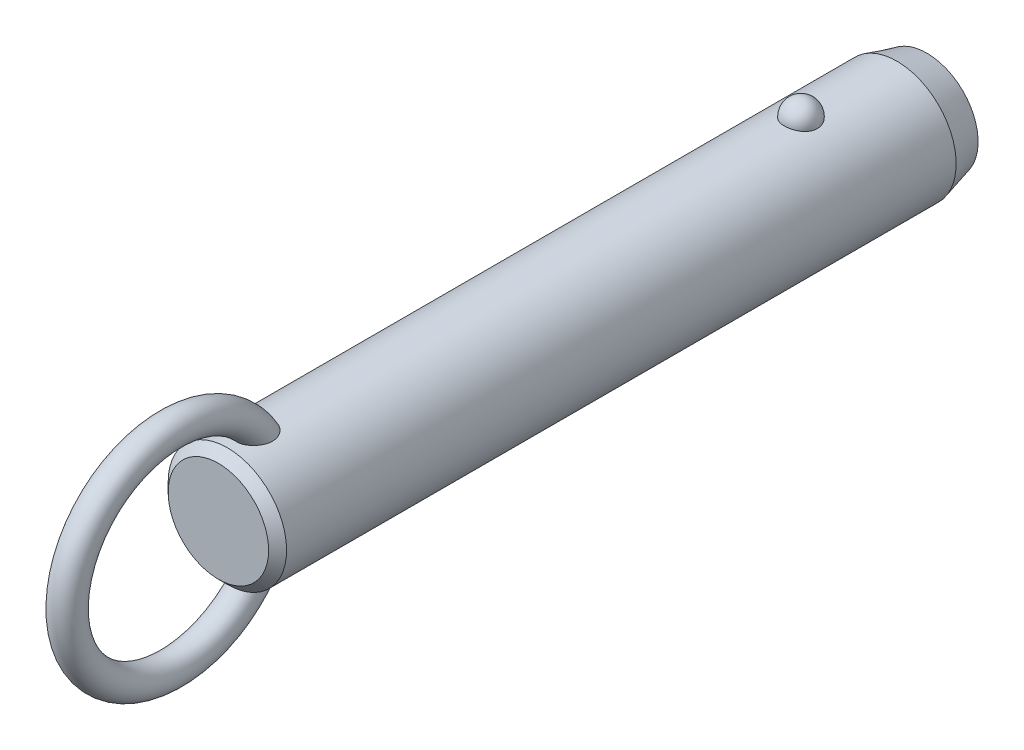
ISO-10303-21;
HEADER;
FILE_DESCRIPTION(('STEP AP214'),'2;1');
FILE_NAME('part.step','',(''),(''),'','','');
FILE_SCHEMA(('AUTOMOTIVE_DESIGN { 1 0 10303 214 1 1 1 1 }'));
ENDSEC;
DATA;
#1=APPLICATION_CONTEXT('core data for automotive mechanical design processes');
#2=APPLICATION_PROTOCOL_DEFINITION('international standard','automotive_design',2000,#1);
#3=PRODUCT_CONTEXT('',#1,'mechanical');
#4=PRODUCT('Part','Part','',(#3));
#5=PRODUCT_RELATED_PRODUCT_CATEGORY('part','',(#4));
#6=PRODUCT_DEFINITION_FORMATION('','',#4);
#7=PRODUCT_DEFINITION_CONTEXT('part definition',#1,'design');
#8=PRODUCT_DEFINITION('design','',#6,#7);
#9=PRODUCT_DEFINITION_SHAPE('','',#8);
#10=(LENGTH_UNIT() NAMED_UNIT(*) SI_UNIT(.MILLI.,.METRE.));
#11=(NAMED_UNIT(*) PLANE_ANGLE_UNIT() SI_UNIT($,.RADIAN.));
#12=(NAMED_UNIT(*) SI_UNIT($,.STERADIAN.) SOLID_ANGLE_UNIT());
#13=UNCERTAINTY_MEASURE_WITH_UNIT(LENGTH_MEASURE(1.E-05),#10,'distance_accuracy_value','');
#14=(GEOMETRIC_REPRESENTATION_CONTEXT(3) GLOBAL_UNCERTAINTY_ASSIGNED_CONTEXT((#13)) GLOBAL_UNIT_ASSIGNED_CONTEXT((#10,
#11,#12)) REPRESENTATION_CONTEXT('',''));
#15=CARTESIAN_POINT('',(0.,0.,0.));
#16=DIRECTION('',(0.,0.,1.));
#17=DIRECTION('',(1.,0.,0.));
#18=AXIS2_PLACEMENT_3D('',#15,#16,#17);
#19=CARTESIAN_POINT('',(0.,0.,66.));
#20=DIRECTION('',(0.,0.,-1.));
#21=DIRECTION('',(-1.,0.,0.));
#22=AXIS2_PLACEMENT_3D('',#19,#20,#21);
#23=CYLINDRICAL_SURFACE('',#22,7.9);
#24=CARTESIAN_POINT('',(2.1785689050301,7.59367088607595,-2.19999999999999));
#25=CARTESIAN_POINT('',(2.17856679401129,7.59367269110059,-2.07701843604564));
#26=CARTESIAN_POINT('',(2.16853481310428,7.59657145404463,-1.95401006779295));
#27=CARTESIAN_POINT('',(2.12864689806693,7.607843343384,-1.71147811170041));
#28=CARTESIAN_POINT('',(2.09878338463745,7.61621856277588,-1.59195587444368));
#29=CARTESIAN_POINT('',(2.0199931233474,7.63749180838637,-1.3598563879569));
#30=CARTESIAN_POINT('',(1.97107475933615,7.6503878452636,-1.24727610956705));
#31=CARTESIAN_POINT('',(1.85539377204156,7.67926115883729,-1.03213234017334));
#32=CARTESIAN_POINT('',(1.78863158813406,7.69523835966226,-0.929568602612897));
#33=CARTESIAN_POINT('',(1.63856494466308,7.7285848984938,-0.736786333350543));
#34=CARTESIAN_POINT('',(1.55518140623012,7.7459606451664,-0.646630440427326));
#35=CARTESIAN_POINT('',(1.37422937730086,7.78009978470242,-0.481747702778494));
#36=CARTESIAN_POINT('',(1.27666086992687,7.79686317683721,-0.407020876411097));
#37=CARTESIAN_POINT('',(1.07024728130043,7.82786153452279,-0.275278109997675));
#38=CARTESIAN_POINT('',(0.961434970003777,7.84210353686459,-0.218212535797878));
#39=CARTESIAN_POINT('',(0.735351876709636,7.86652194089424,-0.123146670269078));
#40=CARTESIAN_POINT('',(0.618082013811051,7.87669878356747,-0.085144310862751));
#41=CARTESIAN_POINT('',(0.380637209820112,7.89170521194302,-0.0298158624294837));
#42=CARTESIAN_POINT('',(0.260550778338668,7.89662650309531,-0.0121347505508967));
#43=CARTESIAN_POINT('',(0.0190117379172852,7.90090003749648,0.00324379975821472));
#44=CARTESIAN_POINT('',(-0.102440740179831,7.90025280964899,0.00094313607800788));
#45=CARTESIAN_POINT('',(-0.341452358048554,7.89351056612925,-0.0233955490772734));
#46=CARTESIAN_POINT('',(-0.459042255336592,7.88749257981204,-0.0451545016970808));
#47=CARTESIAN_POINT('',(-0.688796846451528,7.87075812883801,-0.107408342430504));
#48=CARTESIAN_POINT('',(-0.800961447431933,7.86004158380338,-0.147903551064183));
#49=CARTESIAN_POINT('',(-1.01743634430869,7.83497131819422,-0.246799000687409));
#50=CARTESIAN_POINT('',(-1.12169791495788,7.82059709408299,-0.305300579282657));
#51=CARTESIAN_POINT('',(-1.31891765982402,7.78976470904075,-0.438549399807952));
#52=CARTESIAN_POINT('',(-1.41187469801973,7.77330633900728,-0.513298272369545));
#53=CARTESIAN_POINT('',(-1.58577142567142,7.73972434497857,-0.678622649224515));
#54=CARTESIAN_POINT('',(-1.66645140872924,7.72259402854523,-0.769470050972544));
#55=CARTESIAN_POINT('',(-1.81161503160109,7.68983776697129,-0.963538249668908));
#56=CARTESIAN_POINT('',(-1.87609753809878,7.6742119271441,-1.06675991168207));
#57=CARTESIAN_POINT('',(-1.98790138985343,7.6460202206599,-1.28401170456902));
#58=CARTESIAN_POINT('',(-2.03501994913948,7.63349104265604,-1.39815107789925));
#59=CARTESIAN_POINT('',(-2.10986724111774,7.6131449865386,-1.63301784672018));
#60=CARTESIAN_POINT('',(-2.1375965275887,7.60532797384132,-1.75374505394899));
#61=CARTESIAN_POINT('',(-2.17289256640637,7.5953195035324,-1.99782562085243));
#62=CARTESIAN_POINT('',(-2.18054294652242,7.59310471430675,-2.12116592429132));
#63=CARTESIAN_POINT('',(-2.17572919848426,7.59448538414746,-2.36741799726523));
#64=CARTESIAN_POINT('',(-2.1632656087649,7.59808068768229,-2.49032977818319));
#65=CARTESIAN_POINT('',(-2.11865035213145,7.61064035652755,-2.73161015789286));
#66=CARTESIAN_POINT('',(-2.08659579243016,7.61957823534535,-2.84999812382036));
#67=CARTESIAN_POINT('',(-2.00367799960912,7.64179982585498,-3.07955956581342));
#68=CARTESIAN_POINT('',(-1.9528140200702,7.65508371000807,-3.19073275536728));
#69=CARTESIAN_POINT('',(-1.83321113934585,7.68460381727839,-3.40337899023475));
#70=CARTESIAN_POINT('',(-1.76437735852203,7.70085556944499,-3.50479651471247));
#71=CARTESIAN_POINT('',(-1.61069526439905,7.73445734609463,-3.69446912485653));
#72=CARTESIAN_POINT('',(-1.52584634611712,7.75180741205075,-3.78272371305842));
#73=CARTESIAN_POINT('',(-1.34198059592,7.78574608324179,-3.94393987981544));
#74=CARTESIAN_POINT('',(-1.24291308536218,7.80233167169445,-4.01684434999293));
#75=CARTESIAN_POINT('',(-1.03352039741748,7.83281625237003,-4.14489386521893));
#76=CARTESIAN_POINT('',(-0.92319600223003,7.84671543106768,-4.20004014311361));
#77=CARTESIAN_POINT('',(-0.695822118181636,7.87011575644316,-4.29042017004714));
#78=CARTESIAN_POINT('',(-0.578872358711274,7.87966903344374,-4.32589112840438));
#79=CARTESIAN_POINT('',(-0.340410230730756,7.8935652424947,-4.37692226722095));
#80=CARTESIAN_POINT('',(-0.218898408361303,7.89790879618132,-4.39248482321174));
#81=CARTESIAN_POINT('',(0.0228107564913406,7.90087453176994,-4.40314405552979));
#82=CARTESIAN_POINT('',(0.142990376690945,7.89960185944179,-4.39861683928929));
#83=CARTESIAN_POINT('',(0.380829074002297,7.89171262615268,-4.37008293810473));
#84=CARTESIAN_POINT('',(0.498488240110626,7.8850962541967,-4.34607694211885));
#85=CARTESIAN_POINT('',(0.727535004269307,7.86726442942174,-4.27939317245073));
#86=CARTESIAN_POINT('',(0.838944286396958,7.85606616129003,-4.236785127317));
#87=CARTESIAN_POINT('',(1.05295421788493,7.83025654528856,-4.13408348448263));
#88=CARTESIAN_POINT('',(1.15555431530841,7.81564498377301,-4.07398879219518));
#89=CARTESIAN_POINT('',(1.35076763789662,7.7843022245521,-3.93687432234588));
#90=CARTESIAN_POINT('',(1.4432046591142,7.76754209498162,-3.85961036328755));
#91=CARTESIAN_POINT('',(1.6139111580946,7.73387857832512,-3.69076949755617));
#92=CARTESIAN_POINT('',(1.6921781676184,7.71697516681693,-3.59919010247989));
#93=CARTESIAN_POINT('',(1.83380875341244,7.6845643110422,-3.40247278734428));
#94=CARTESIAN_POINT('',(1.89689280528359,7.66908588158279,-3.29712873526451));
#95=CARTESIAN_POINT('',(2.0047823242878,7.64159441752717,-3.07707931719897));
#96=CARTESIAN_POINT('',(2.0495945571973,7.62958010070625,-2.96237743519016));
#97=CARTESIAN_POINT('',(2.11580183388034,7.61146617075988,-2.74040519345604));
#98=CARTESIAN_POINT('',(2.13929812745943,7.60484503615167,-2.63379846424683));
#99=CARTESIAN_POINT('',(2.17068242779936,7.59594664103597,-2.41813481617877));
#100=CARTESIAN_POINT('',(2.17857077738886,7.59366928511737,-2.30907795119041));
#101=CARTESIAN_POINT('',(2.1785689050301,7.59367088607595,-2.19999999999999));
#102=B_SPLINE_CURVE_WITH_KNOTS('',3,(#24,#25,#26,#27,#28,#29,#30,#31,#32,#33,#34,#35,#36,#37,
#38,#39,#40,#41,#42,#43,#44,#45,#46,#47,#48,#49,#50,#51,#52,#53,#54,#55,#56,#57,#58,#59,#60,#61,
#62,#63,#64,#65,#66,#67,#68,#69,#70,#71,#72,#73,#74,#75,#76,#77,#78,#79,#80,#81,#82,#83,#84,#85,
#86,#87,#88,#89,#90,#91,#92,#93,#94,#95,#96,#97,#98,#99,#100,#101),.UNSPECIFIED.,.T.,.F.,(4,2,2,
2,2,2,2,2,2,2,2,2,2,2,2,2,2,2,2,2,2,2,2,2,2,2,2,2,2,2,2,2,2,2,2,2,2,2,4),(0.,0.368552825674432,
0.737246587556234,1.10577831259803,1.4743009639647,1.8446206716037,2.21494081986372,
2.5842105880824,2.95344028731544,3.31611630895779,3.67875788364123,4.03628044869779,
4.39380913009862,4.75338791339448,5.11300280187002,5.47939989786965,5.8458226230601,
6.21639834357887,6.58696347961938,6.95598276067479,7.32499216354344,7.69218715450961,
8.0593967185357,8.42858578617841,8.79778880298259,9.16834203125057,9.5388695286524,
9.90482699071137,10.2707407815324,10.6298333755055,10.9889132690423,11.3466585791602,
11.7044262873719,12.0676511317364,12.4309391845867,12.8004764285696,13.1698767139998,
13.4967701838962,13.8236564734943),.UNSPECIFIED.);
#103=CARTESIAN_POINT('',(2.1785689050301,7.59367088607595,-2.19999999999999));
#104=VERTEX_POINT('',#103);
#105=EDGE_CURVE('E41',#104,#104,#102,.T.);
#106=ORIENTED_EDGE('',*,*,#105,.T.);
#107=EDGE_LOOP('',(#106));
#108=FACE_BOUND('',#107,.T.);
#109=CARTESIAN_POINT('',(0.,0.,74.32));
#110=DIRECTION('',(0.,0.,1.));
#111=DIRECTION('',(1.,0.,0.));
#112=AXIS2_PLACEMENT_3D('',#109,#110,#111);
#113=CIRCLE('',#112,7.9);
#114=CARTESIAN_POINT('',(7.9,0.,74.32));
#115=VERTEX_POINT('',#114);
#116=EDGE_CURVE('E10',#115,#115,#113,.F.);
#117=ORIENTED_EDGE('',*,*,#116,.T.);
#118=EDGE_LOOP('',(#117));
#119=FACE_BOUND('',#118,.T.);
#120=CARTESIAN_POINT('',(-0.630969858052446,-7.87476203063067,68.2124322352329));
#121=CARTESIAN_POINT('',(-0.73418033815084,-7.8664899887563,68.247285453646));
#122=CARTESIAN_POINT('',(-0.834476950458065,-7.85639291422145,68.2908160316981));
#123=CARTESIAN_POINT('',(-1.02620356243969,-7.83366343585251,68.3940948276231));
#124=CARTESIAN_POINT('',(-1.1176141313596,-7.82102565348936,68.4538775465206));
#125=CARTESIAN_POINT('',(-1.28877277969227,-7.79464922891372,68.5878390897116));
#126=CARTESIAN_POINT('',(-1.36854014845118,-7.78091246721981,68.661993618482));
#127=CARTESIAN_POINT('',(-1.5146152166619,-7.75380398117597,68.8224941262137));
#128=CARTESIAN_POINT('',(-1.58092966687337,-7.74043207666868,68.9088339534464));
#129=CARTESIAN_POINT('',(-1.70019064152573,-7.71512522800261,69.0929784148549));
#130=CARTESIAN_POINT('',(-1.75284037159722,-7.70322473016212,69.1909792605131));
#131=CARTESIAN_POINT('',(-1.84263464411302,-7.68224112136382,69.3941029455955));
#132=CARTESIAN_POINT('',(-1.87977299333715,-7.6731591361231,69.4992286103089));
#133=CARTESIAN_POINT('',(-1.94152728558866,-7.65777930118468,69.7232849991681));
#134=CARTESIAN_POINT('',(-1.96475471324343,-7.65179654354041,69.8426167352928));
#135=CARTESIAN_POINT('',(-1.99449499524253,-7.64409642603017,70.0834298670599));
#136=CARTESIAN_POINT('',(-2.0010005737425,-7.64238092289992,70.2049121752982));
#137=CARTESIAN_POINT('',(-1.99856014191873,-7.64302120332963,70.4683409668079));
#138=CARTESIAN_POINT('',(-1.98680021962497,-7.64611845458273,70.6102565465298));
#139=CARTESIAN_POINT('',(-1.94457772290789,-7.65696186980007,70.8911188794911));
#140=CARTESIAN_POINT('',(-1.91409393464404,-7.66471330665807,71.0300620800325));
#141=CARTESIAN_POINT('',(-1.82768670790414,-7.68582947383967,71.331939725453));
#142=CARTESIAN_POINT('',(-1.76772963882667,-7.70003779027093,71.493686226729));
#143=CARTESIAN_POINT('',(-1.65998501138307,-7.72371550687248,71.7276956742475));
#144=CARTESIAN_POINT('',(-1.621079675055,-7.73200670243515,71.8042974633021));
#145=CARTESIAN_POINT('',(-1.53727726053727,-7.74910377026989,71.9540798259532));
#146=CARTESIAN_POINT('',(-1.49238215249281,-7.75790947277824,72.0272615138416));
#147=CARTESIAN_POINT('',(-1.3739705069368,-7.77993338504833,72.2028838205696));
#148=CARTESIAN_POINT('',(-1.29690364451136,-7.79328473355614,72.3029557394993));
#149=CARTESIAN_POINT('',(-1.1288548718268,-7.81939266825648,72.4907147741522));
#150=CARTESIAN_POINT('',(-1.03789926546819,-7.83215032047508,72.5784247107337));
#151=CARTESIAN_POINT('',(-0.869532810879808,-7.85231710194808,72.7134148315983));
#152=CARTESIAN_POINT('',(-0.795716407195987,-7.86021093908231,72.765076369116));
#153=CARTESIAN_POINT('',(-0.640813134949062,-7.87434920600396,72.8563815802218));
#154=CARTESIAN_POINT('',(-0.559737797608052,-7.88059619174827,72.8960438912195));
#155=CARTESIAN_POINT('',(-0.406456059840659,-7.88984116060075,72.9543008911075));
#156=CARTESIAN_POINT('',(-0.335227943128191,-7.89321892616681,72.9753848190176));
#157=CARTESIAN_POINT('',(-0.19019307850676,-7.89804235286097,73.0054141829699));
#158=CARTESIAN_POINT('',(-0.11638863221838,-7.89948969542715,73.0143701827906));
#159=CARTESIAN_POINT('',(0.0318414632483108,-7.90028409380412,73.0192915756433));
#160=CARTESIAN_POINT('',(0.106268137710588,-7.89962640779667,73.0152276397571));
#161=CARTESIAN_POINT('',(0.253290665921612,-7.8962818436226,72.9944615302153));
#162=CARTESIAN_POINT('',(0.32588518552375,-7.8935935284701,72.9777504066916));
#163=CARTESIAN_POINT('',(0.481441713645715,-7.88577340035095,72.9287380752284));
#164=CARTESIAN_POINT('',(0.563611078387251,-7.88026321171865,72.894005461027));
#165=CARTESIAN_POINT('',(0.721129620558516,-7.86741729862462,72.8117965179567));
#166=CARTESIAN_POINT('',(0.796466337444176,-7.86007832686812,72.7642975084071));
#167=CARTESIAN_POINT('',(0.971456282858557,-7.84073285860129,72.636513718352));
#168=CARTESIAN_POINT('',(1.0671968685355,-7.82809461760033,72.5510047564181));
#169=CARTESIAN_POINT('',(1.24418921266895,-7.80192439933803,72.366232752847));
#170=CARTESIAN_POINT('',(1.32540832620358,-7.78839049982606,72.2669395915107));
#171=CARTESIAN_POINT('',(1.45199971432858,-7.76559693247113,72.0895760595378));
#172=CARTESIAN_POINT('',(1.50085649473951,-7.75626094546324,72.0139542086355));
#173=CARTESIAN_POINT('',(1.59197749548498,-7.7380727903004,71.8587428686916));
#174=CARTESIAN_POINT('',(1.63423919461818,-7.72922080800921,71.7791518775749));
#175=CARTESIAN_POINT('',(1.71222612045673,-7.71231959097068,71.6166640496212));
#176=CARTESIAN_POINT('',(1.74794516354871,-7.70427111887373,71.5337641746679));
#177=CARTESIAN_POINT('',(1.81270113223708,-7.68929240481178,71.3652967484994));
#178=CARTESIAN_POINT('',(1.84173789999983,-7.68236218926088,71.2797291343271));
#179=CARTESIAN_POINT('',(1.89322698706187,-7.6698375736,71.1052870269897));
#180=CARTESIAN_POINT('',(1.91558744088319,-7.66426199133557,71.0163838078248));
#181=CARTESIAN_POINT('',(1.95281367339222,-7.65485915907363,70.8369696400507));
#182=CARTESIAN_POINT('',(1.96767946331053,-7.65103190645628,70.7464586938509));
#183=CARTESIAN_POINT('',(2.00021456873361,-7.64262981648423,70.4737320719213));
#184=CARTESIAN_POINT('',(2.00600691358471,-7.6410871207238,70.2897099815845));
#185=CARTESIAN_POINT('',(1.98445334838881,-7.64669564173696,69.9765019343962));
#186=CARTESIAN_POINT('',(1.96607186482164,-7.65149688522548,69.8466189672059));
#187=CARTESIAN_POINT('',(1.90884967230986,-7.6659762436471,69.5916321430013));
#188=CARTESIAN_POINT('',(1.8700210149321,-7.67565148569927,69.466525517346));
#189=CARTESIAN_POINT('',(1.77063986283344,-7.69918471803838,69.2245401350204));
#190=CARTESIAN_POINT('',(1.70993724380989,-7.71307150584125,69.1077250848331));
#191=CARTESIAN_POINT('',(1.5673307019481,-7.74330306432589,68.8881444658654));
#192=CARTESIAN_POINT('',(1.48543692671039,-7.75964665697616,68.7853722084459));
#193=CARTESIAN_POINT('',(1.31346177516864,-7.79047523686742,68.6093800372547));
#194=CARTESIAN_POINT('',(1.22547278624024,-7.80495298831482,68.5341066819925));
#195=CARTESIAN_POINT('',(1.03724352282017,-7.83218597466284,68.4004864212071));
#196=CARTESIAN_POINT('',(0.937008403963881,-7.84494192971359,68.3421324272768));
#197=CARTESIAN_POINT('',(0.733599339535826,-7.86649045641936,68.2470270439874));
#198=CARTESIAN_POINT('',(0.630941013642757,-7.87547134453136,68.2092109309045));
#199=CARTESIAN_POINT('',(0.420465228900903,-7.88950708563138,68.1511160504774));
#200=CARTESIAN_POINT('',(0.312645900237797,-7.89456050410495,68.1308436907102));
#201=CARTESIAN_POINT('',(0.0960869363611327,-7.9001518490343,68.1084559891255));
#202=CARTESIAN_POINT('',(-0.0126341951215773,-7.90073226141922,68.1061698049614));
#203=CARTESIAN_POINT('',(-0.228766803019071,-7.89742350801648,68.1193678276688));
#204=CARTESIAN_POINT('',(-0.336180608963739,-7.89354403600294,68.1348134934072));
#205=CARTESIAN_POINT('',(-0.473410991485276,-7.88586871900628,68.1662177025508));
#206=CARTESIAN_POINT('',(-0.50525779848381,-7.88388984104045,68.1743541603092));
#207=CARTESIAN_POINT('',(-0.5684812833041,-7.87958326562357,68.1922083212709));
#208=CARTESIAN_POINT('',(-0.599857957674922,-7.87725556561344,68.2019260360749));
#209=CARTESIAN_POINT('',(-0.630969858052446,-7.87476203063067,68.2124322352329));
#210=B_SPLINE_CURVE_WITH_KNOTS('',3,(#120,#121,#122,#123,#124,#125,#126,#127,#128,#129,#130,
#131,#132,#133,#134,#135,#136,#137,#138,#139,#140,#141,#142,#143,#144,#145,#146,#147,#148,#149,
#150,#151,#152,#153,#154,#155,#156,#157,#158,#159,#160,#161,#162,#163,#164,#165,#166,#167,#168,
#169,#170,#171,#172,#173,#174,#175,#176,#177,#178,#179,#180,#181,#182,#183,#184,#185,#186,#187,
#188,#189,#190,#191,#192,#193,#194,#195,#196,#197,#198,#199,#200,#201,#202,#203,#204,#205,#206,
#207,#208,#209),.UNSPECIFIED.,.T.,.F.,(4,2,2,2,2,2,2,2,2,2,2,2,2,2,2,2,2,2,2,2,2,2,2,2,2,2,2,2,
2,2,2,2,2,2,2,2,2,2,2,2,2,2,2,2,4),(0.,0.327622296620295,0.655945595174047,0.983718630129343,
1.3113267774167,1.64554655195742,1.9798996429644,2.3436572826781,2.70757317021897,
3.13333684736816,3.55958380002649,4.07655306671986,4.3352789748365,4.59391999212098,
4.97382437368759,5.35301797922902,5.62348245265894,5.89352465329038,6.11565959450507,
6.3376009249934,6.56004255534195,6.78264174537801,7.04930844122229,7.31645206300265,
7.70130871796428,8.08701995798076,8.35824509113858,8.62957365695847,8.90115735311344,
9.17274746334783,9.44791855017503,9.72308922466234,10.2715298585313,10.6638393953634,
11.0559179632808,11.4507403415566,11.845374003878,12.1936425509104,12.5417649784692,
12.8695063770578,13.1973674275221,13.5221104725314,13.8461490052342,13.9449071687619,
14.0436660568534),.UNSPECIFIED.);
#211=CARTESIAN_POINT('',(-0.630969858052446,-7.87476203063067,68.2124322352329));
#212=VERTEX_POINT('',#211);
#213=EDGE_CURVE('E59',#212,#212,#210,.T.);
#214=ORIENTED_EDGE('',*,*,#213,.T.);
#215=EDGE_LOOP('',(#214));
#216=FACE_BOUND('',#215,.T.);
#217=CARTESIAN_POINT('',(-0.630969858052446,7.87476203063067,68.2124322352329));
#218=CARTESIAN_POINT('',(-0.528918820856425,7.88293636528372,68.1779798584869));
#219=CARTESIAN_POINT('',(-0.423745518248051,7.8893481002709,68.151915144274));
#220=CARTESIAN_POINT('',(-0.210236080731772,7.8979273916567,68.1172825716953));
#221=CARTESIAN_POINT('',(-0.10189380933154,7.90008607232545,68.1087513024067));
#222=CARTESIAN_POINT('',(0.114660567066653,7.89990877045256,68.1094570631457));
#223=CARTESIAN_POINT('',(0.222872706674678,7.89757640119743,68.1186798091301));
#224=CARTESIAN_POINT('',(0.436107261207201,7.88867538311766,68.1546525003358));
#225=CARTESIAN_POINT('',(0.541131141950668,7.8821087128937,68.1813942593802));
#226=CARTESIAN_POINT('',(0.745085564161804,7.86545130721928,68.2517561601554));
#227=CARTESIAN_POINT('',(0.844015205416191,7.85536005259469,68.2953787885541));
#228=CARTESIAN_POINT('',(1.03299167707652,7.83275153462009,68.3983796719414));
#229=CARTESIAN_POINT('',(1.12303841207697,7.8202342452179,68.4577580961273));
#230=CARTESIAN_POINT('',(1.29214734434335,7.79408219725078,68.5908647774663));
#231=CARTESIAN_POINT('',(1.37116907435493,7.78044359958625,68.6646436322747));
#232=CARTESIAN_POINT('',(1.51597677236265,7.75353170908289,68.8242353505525));
#233=CARTESIAN_POINT('',(1.58176261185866,7.74025841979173,68.9100483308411));
#234=CARTESIAN_POINT('',(1.70057386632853,7.71504069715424,69.093644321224));
#235=CARTESIAN_POINT('',(1.75320073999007,7.70314257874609,69.1916906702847));
#236=CARTESIAN_POINT('',(1.84293767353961,7.68216822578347,69.3948931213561));
#237=CARTESIAN_POINT('',(1.88004278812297,7.67309289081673,69.5000514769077));
#238=CARTESIAN_POINT('',(1.9417232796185,7.6577294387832,69.7241671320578));
#239=CARTESIAN_POINT('',(1.96491037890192,7.65175648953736,69.8435248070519));
#240=CARTESIAN_POINT('',(1.9945689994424,7.64407702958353,70.0843848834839));
#241=CARTESIAN_POINT('',(2.00103304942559,7.64237242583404,70.2058882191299));
#242=CARTESIAN_POINT('',(1.9985016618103,7.64303650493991,70.4693688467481));
#243=CARTESIAN_POINT('',(1.98669038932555,7.64614714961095,70.6113141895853));
#244=CARTESIAN_POINT('',(1.94436120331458,7.6570170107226,70.8922287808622));
#245=CARTESIAN_POINT('',(1.91382203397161,7.66478150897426,71.0311944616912));
#246=CARTESIAN_POINT('',(1.82728754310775,7.68592483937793,71.3331110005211));
#247=CARTESIAN_POINT('',(1.76725778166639,7.7001468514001,71.494872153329));
#248=CARTESIAN_POINT('',(1.65939700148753,7.72384204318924,71.7288914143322));
#249=CARTESIAN_POINT('',(1.62045187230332,7.73213852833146,71.8054942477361));
#250=CARTESIAN_POINT('',(1.53656684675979,7.74924489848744,71.9552737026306));
#251=CARTESIAN_POINT('',(1.49162892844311,7.75805461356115,72.0284514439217));
#252=CARTESIAN_POINT('',(1.37317698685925,7.78007342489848,72.2039520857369));
#253=CARTESIAN_POINT('',(1.29612360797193,7.79341423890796,72.3039112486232));
#254=CARTESIAN_POINT('',(1.12812043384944,7.81949839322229,72.4914508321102));
#255=CARTESIAN_POINT('',(1.03719688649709,7.83224280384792,72.5790540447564));
#256=CARTESIAN_POINT('',(0.868871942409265,7.85239026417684,72.7138971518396));
#257=CARTESIAN_POINT('',(0.795056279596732,7.86027769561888,72.7655113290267));
#258=CARTESIAN_POINT('',(0.640160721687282,7.87440222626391,72.8567201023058));
#259=CARTESIAN_POINT('',(0.559092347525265,7.88064188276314,72.8963333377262));
#260=CARTESIAN_POINT('',(0.405820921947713,7.8898738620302,72.9545056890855));
#261=CARTESIAN_POINT('',(0.334594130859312,7.89324577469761,72.9755523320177));
#262=CARTESIAN_POINT('',(0.189568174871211,7.89805733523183,73.0055070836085));
#263=CARTESIAN_POINT('',(0.115771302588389,7.89949866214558,73.0144257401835));
#264=CARTESIAN_POINT('',(-0.0324359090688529,7.90028156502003,73.0192758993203));
#265=CARTESIAN_POINT('',(-0.106847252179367,7.89961843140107,73.0151782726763));
#266=CARTESIAN_POINT('',(-0.253834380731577,7.8962642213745,72.9943519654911));
#267=CARTESIAN_POINT('',(-0.326408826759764,7.89357170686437,72.9776143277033));
#268=CARTESIAN_POINT('',(-0.481962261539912,7.88574179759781,72.9285391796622));
#269=CARTESIAN_POINT('',(-0.564145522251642,7.88022507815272,72.8937638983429));
#270=CARTESIAN_POINT('',(-0.721685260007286,7.86736646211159,72.8114686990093));
#271=CARTESIAN_POINT('',(-0.797029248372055,7.8600213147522,72.7639260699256));
#272=CARTESIAN_POINT('',(-0.972044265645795,7.84066026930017,72.6360267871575));
#273=CARTESIAN_POINT('',(-1.06779803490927,7.82801274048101,72.5504436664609));
#274=CARTESIAN_POINT('',(-1.24480531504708,7.80182621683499,72.3655223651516));
#275=CARTESIAN_POINT('',(-1.32602618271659,7.78828530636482,72.2661540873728));
#276=CARTESIAN_POINT('',(-1.45259834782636,7.76548487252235,72.0886806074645));
#277=CARTESIAN_POINT('',(-1.50143856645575,7.75614818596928,72.0130252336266));
#278=CARTESIAN_POINT('',(-1.59252410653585,7.73796020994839,71.8577484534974));
#279=CARTESIAN_POINT('',(-1.63476690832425,7.72910910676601,71.7781255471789));
#280=CARTESIAN_POINT('',(-1.71271318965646,7.71221133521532,71.6155750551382));
#281=CARTESIAN_POINT('',(-1.74841047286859,7.70416543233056,71.5326444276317));
#282=CARTESIAN_POINT('',(-1.81311929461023,7.6891937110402,71.3641168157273));
#283=CARTESIAN_POINT('',(-1.84213067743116,7.6822679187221,71.2785197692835));
#284=CARTESIAN_POINT('',(-1.89356259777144,7.66975461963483,71.1040254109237));
#285=CARTESIAN_POINT('',(-1.91589165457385,7.66418586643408,71.0150995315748));
#286=CARTESIAN_POINT('',(-1.95305070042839,7.65479859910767,70.8356424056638));
#287=CARTESIAN_POINT('',(-1.96788069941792,7.65098008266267,70.7451111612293));
#288=CARTESIAN_POINT('',(-2.00030078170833,7.64260704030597,70.4723270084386));
#289=CARTESIAN_POINT('',(-2.00600576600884,7.64108760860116,70.2882718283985));
#290=CARTESIAN_POINT('',(-1.98428483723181,7.64673945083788,69.9750800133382));
#291=CARTESIAN_POINT('',(-1.96583698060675,7.6515575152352,69.8452400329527));
#292=CARTESIAN_POINT('',(-1.90848948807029,7.66606613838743,69.5903619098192));
#293=CARTESIAN_POINT('',(-1.86960376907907,7.67575338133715,69.465320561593));
#294=CARTESIAN_POINT('',(-1.7701342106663,7.69930132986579,69.2235009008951));
#295=CARTESIAN_POINT('',(-1.70940488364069,7.71318991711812,69.1067844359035));
#296=CARTESIAN_POINT('',(-1.56672953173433,7.74342495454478,68.8873404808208));
#297=CARTESIAN_POINT('',(-1.48478316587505,7.75977144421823,68.7846132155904));
#298=CARTESIAN_POINT('',(-1.31266325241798,7.79061163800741,68.6086431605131));
#299=CARTESIAN_POINT('',(-1.22456383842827,7.80509908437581,68.5333589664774));
#300=CARTESIAN_POINT('',(-1.03622400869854,7.83231881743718,68.3998659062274));
#301=CARTESIAN_POINT('',(-0.936015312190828,7.84505551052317,68.3416137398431));
#302=CARTESIAN_POINT('',(-0.798824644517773,7.85957802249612,68.2775408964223));
#303=CARTESIAN_POINT('',(-0.765787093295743,7.86286821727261,68.2632248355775));
#304=CARTESIAN_POINT('',(-0.698939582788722,7.86909211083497,68.236436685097));
#305=CARTESIAN_POINT('',(-0.66512963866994,7.8720258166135,68.2239645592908));
#306=CARTESIAN_POINT('',(-0.630969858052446,7.87476203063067,68.2124322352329));
#307=B_SPLINE_CURVE_WITH_KNOTS('',3,(#217,#218,#219,#220,#221,#222,#223,#224,#225,#226,#227,
#228,#229,#230,#231,#232,#233,#234,#235,#236,#237,#238,#239,#240,#241,#242,#243,#244,#245,#246,
#247,#248,#249,#250,#251,#252,#253,#254,#255,#256,#257,#258,#259,#260,#261,#262,#263,#264,#265,
#266,#267,#268,#269,#270,#271,#272,#273,#274,#275,#276,#277,#278,#279,#280,#281,#282,#283,#284,
#285,#286,#287,#288,#289,#290,#291,#292,#293,#294,#295,#296,#297,#298,#299,#300,#301,#302,#303,
#304,#305,#306),.UNSPECIFIED.,.T.,.F.,(4,2,2,2,2,2,2,2,2,2,2,2,2,2,2,2,2,2,2,2,2,2,2,2,2,2,2,2,
2,2,2,2,2,2,2,2,2,2,2,2,2,2,2,2,4),(0.,0.323920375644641,0.648516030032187,0.97285063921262,
1.29703380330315,1.62126473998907,1.94549915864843,2.27089401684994,2.5962920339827,
2.93059633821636,3.26500707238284,3.62881644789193,3.99278833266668,4.41865421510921,
4.84500434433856,5.36209210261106,5.62087589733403,5.87957448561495,6.25918598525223,
6.63808782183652,6.90846748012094,7.17842501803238,7.40052350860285,7.62242871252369,
7.84483086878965,8.06739077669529,8.33414615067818,8.60137921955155,8.98641454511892,
9.3723041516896,9.64358673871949,9.91497268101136,10.1866142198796,10.4582620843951,
10.7334745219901,11.0086865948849,11.5572126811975,11.9494246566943,12.3413699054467,
12.7359755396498,13.1305875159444,13.4791770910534,13.82687259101,13.9353013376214,
14.0437279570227),.UNSPECIFIED.);
#308=CARTESIAN_POINT('',(-0.630969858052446,7.87476203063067,68.2124322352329));
#309=VERTEX_POINT('',#308);
#310=EDGE_CURVE('E67',#309,#309,#307,.T.);
#311=ORIENTED_EDGE('',*,*,#310,.T.);
#312=EDGE_LOOP('',(#311));
#313=FACE_BOUND('',#312,.T.);
#314=CARTESIAN_POINT('',(0.,0.,-14.9999999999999));
#315=DIRECTION('',(0.,0.,-1.));
#316=DIRECTION('',(-1.,0.,0.));
#317=AXIS2_PLACEMENT_3D('',#314,#315,#316);
#318=CIRCLE('',#317,7.9);
#319=CARTESIAN_POINT('',(-7.9,0.,-14.9999999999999));
#320=VERTEX_POINT('',#319);
#321=EDGE_CURVE('E56',#320,#320,#318,.F.);
#322=ORIENTED_EDGE('',*,*,#321,.T.);
#323=EDGE_LOOP('',(#322));
#324=FACE_BOUND('',#323,.T.);
#325=ADVANCED_FACE('F37',(#108,#119,#216,#313,#324),#23,.T.);
#326=CARTESIAN_POINT('',(0.,0.,-19.));
#327=DIRECTION('',(0.,0.,-1.));
#328=DIRECTION('',(-1.,0.,0.));
#329=AXIS2_PLACEMENT_3D('',#326,#327,#328);
#330=PLANE('',#329);
#331=CARTESIAN_POINT('',(0.,0.,-19.));
#332=DIRECTION('',(0.,0.,-1.));
#333=DIRECTION('',(-1.,0.,0.));
#334=AXIS2_PLACEMENT_3D('',#331,#332,#333);
#335=CIRCLE('',#334,6.8282032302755);
#336=CARTESIAN_POINT('',(-6.8282032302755,0.,-19.));
#337=VERTEX_POINT('',#336);
#338=EDGE_CURVE('E66',#337,#337,#335,.T.);
#339=ORIENTED_EDGE('',*,*,#338,.T.);
#340=EDGE_LOOP('',(#339));
#341=FACE_BOUND('',#340,.T.);
#342=ADVANCED_FACE('F85',(#341),#330,.T.);
#343=CARTESIAN_POINT('',(0.,0.,-19.));
#344=DIRECTION('',(0.,0.,1.));
#345=DIRECTION('',(1.,0.,0.));
#346=AXIS2_PLACEMENT_3D('',#343,#344,#345);
#347=CONICAL_SURFACE('',#346,6.8282032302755,0.261799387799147);
#348=ORIENTED_EDGE('',*,*,#321,.F.);
#349=EDGE_LOOP('',(#348));
#350=FACE_BOUND('',#349,.T.);
#351=ORIENTED_EDGE('',*,*,#338,.F.);
#352=EDGE_LOOP('',(#351));
#353=FACE_BOUND('',#352,.T.);
#354=ADVANCED_FACE('F83',(#350,#353),#347,.T.);
#355=CARTESIAN_POINT('',(0.,0.,75.52));
#356=DIRECTION('',(0.,0.,1.));
#357=DIRECTION('',(1.,0.,0.));
#358=AXIS2_PLACEMENT_3D('',#355,#356,#357);
#359=PLANE('',#358);
#360=CARTESIAN_POINT('',(0.,0.,75.52));
#361=DIRECTION('',(0.,0.,1.));
#362=DIRECTION('',(1.,0.,0.));
#363=AXIS2_PLACEMENT_3D('',#360,#361,#362);
#364=CIRCLE('',#363,6.7);
#365=CARTESIAN_POINT('',(6.7,0.,75.52));
#366=VERTEX_POINT('',#365);
#367=EDGE_CURVE('E50',#366,#366,#364,.T.);
#368=ORIENTED_EDGE('',*,*,#367,.T.);
#369=EDGE_LOOP('',(#368));
#370=FACE_BOUND('',#369,.T.);
#371=ADVANCED_FACE('F77',(#370),#359,.T.);
#372=CARTESIAN_POINT('',(0.,0.,81.85));
#373=DIRECTION('',(1.,0.,0.));
#374=DIRECTION('',(0.,0.,-1.));
#375=AXIS2_PLACEMENT_3D('',#372,#373,#374);
#376=TOROIDAL_SURFACE('',#375,13.85,2.);
#377=ORIENTED_EDGE('',*,*,#310,.F.);
#378=EDGE_LOOP('',(#377));
#379=FACE_BOUND('',#378,.T.);
#380=ORIENTED_EDGE('',*,*,#213,.F.);
#381=EDGE_LOOP('',(#380));
#382=FACE_BOUND('',#381,.T.);
#383=ADVANCED_FACE('F73',(#379,#382),#376,.T.);
#384=CARTESIAN_POINT('',(0.,0.,75.52));
#385=DIRECTION('',(0.,0.,-1.));
#386=DIRECTION('',(-1.,0.,0.));
#387=AXIS2_PLACEMENT_3D('',#384,#385,#386);
#388=CONICAL_SURFACE('',#387,6.7,0.785398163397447);
#389=ORIENTED_EDGE('',*,*,#116,.F.);
#390=EDGE_LOOP('',(#389));
#391=FACE_BOUND('',#390,.T.);
#392=ORIENTED_EDGE('',*,*,#367,.F.);
#393=EDGE_LOOP('',(#392));
#394=FACE_BOUND('',#393,.T.);
#395=ADVANCED_FACE('F39',(#391,#394),#388,.T.);
#396=CARTESIAN_POINT('',(0.,7.9,-2.19999999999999));
#397=DIRECTION('',(0.,1.,0.));
#398=DIRECTION('',(0.,0.,-1.));
#399=AXIS2_PLACEMENT_3D('',#396,#397,#398);
#400=SPHERICAL_SURFACE('',#399,2.2);
#401=ORIENTED_EDGE('',*,*,#105,.F.);
#402=EDGE_LOOP('',(#401));
#403=FACE_BOUND('',#402,.T.);
#404=ADVANCED_FACE('F79',(#403),#400,.T.);
#405=CLOSED_SHELL('',(#325,#342,#354,#371,#383,#395,#404));
#406=MANIFOLD_SOLID_BREP('B2',#405);
#407=ADVANCED_BREP_SHAPE_REPRESENTATION('',(#18,#406),#14);
#408=SHAPE_DEFINITION_REPRESENTATION(#9,#407);
ENDSEC;
END-ISO-10303-21;
